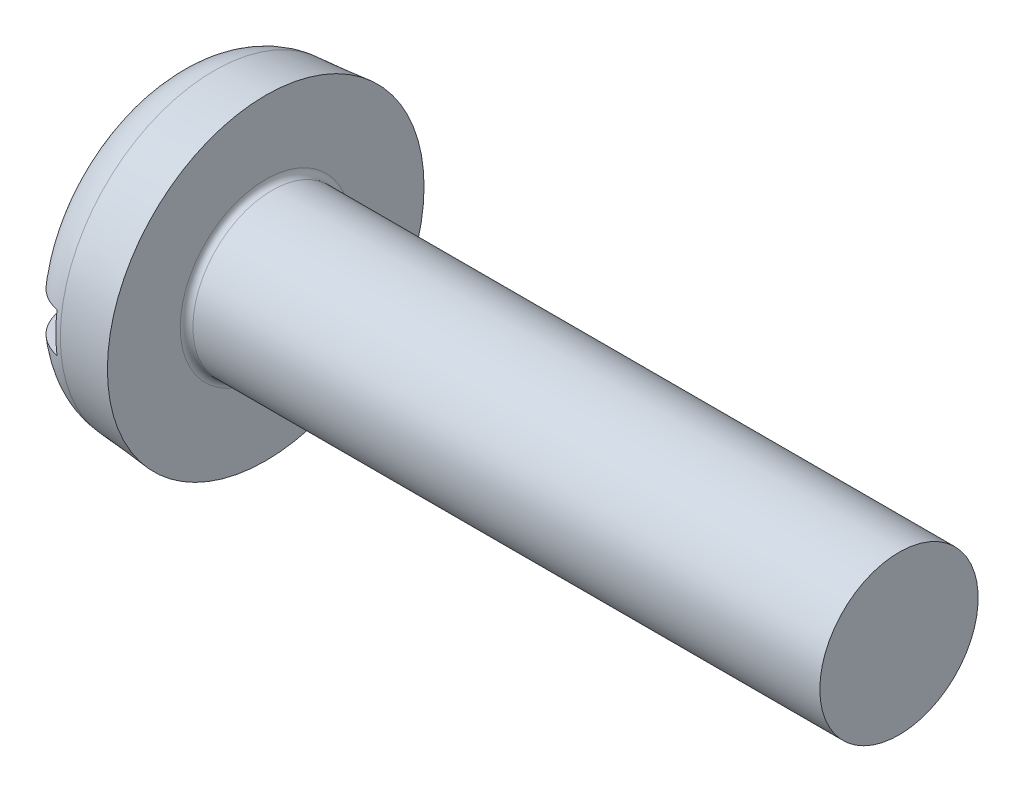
ISO-10303-21;
HEADER;
FILE_DESCRIPTION(('STEP AP214'),'2;1');
FILE_NAME('part.step','',(''),(''),'','','');
FILE_SCHEMA(('AUTOMOTIVE_DESIGN { 1 0 10303 214 1 1 1 1 }'));
ENDSEC;
DATA;
#1=APPLICATION_CONTEXT('core data for automotive mechanical design processes');
#2=APPLICATION_PROTOCOL_DEFINITION('international standard','automotive_design',2000,#1);
#3=PRODUCT_CONTEXT('',#1,'mechanical');
#4=PRODUCT('Part','Part','',(#3));
#5=PRODUCT_RELATED_PRODUCT_CATEGORY('part','',(#4));
#6=PRODUCT_DEFINITION_FORMATION('','',#4);
#7=PRODUCT_DEFINITION_CONTEXT('part definition',#1,'design');
#8=PRODUCT_DEFINITION('design','',#6,#7);
#9=PRODUCT_DEFINITION_SHAPE('','',#8);
#10=(LENGTH_UNIT() NAMED_UNIT(*) SI_UNIT(.MILLI.,.METRE.));
#11=(NAMED_UNIT(*) PLANE_ANGLE_UNIT() SI_UNIT($,.RADIAN.));
#12=(NAMED_UNIT(*) SI_UNIT($,.STERADIAN.) SOLID_ANGLE_UNIT());
#13=UNCERTAINTY_MEASURE_WITH_UNIT(LENGTH_MEASURE(1.E-05),#10,'distance_accuracy_value','');
#14=(GEOMETRIC_REPRESENTATION_CONTEXT(3) GLOBAL_UNCERTAINTY_ASSIGNED_CONTEXT((#13)) GLOBAL_UNIT_ASSIGNED_CONTEXT((#10,
#11,#12)) REPRESENTATION_CONTEXT('',''));
#15=CARTESIAN_POINT('',(0.,0.,0.));
#16=DIRECTION('',(0.,0.,1.));
#17=DIRECTION('',(1.,0.,0.));
#18=AXIS2_PLACEMENT_3D('',#15,#16,#17);
#19=CARTESIAN_POINT('',(0.,0.,0.));
#20=DIRECTION('',(1.,0.,0.));
#21=DIRECTION('',(0.,0.,-1.));
#22=AXIS2_PLACEMENT_3D('',#19,#20,#21);
#23=PLANE('',#22);
#24=CARTESIAN_POINT('',(0.,0.,0.));
#25=DIRECTION('',(1.,0.,0.));
#26=DIRECTION('',(0.,0.,-1.));
#27=AXIS2_PLACEMENT_3D('',#24,#25,#26);
#28=CIRCLE('',#27,6.72607449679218);
#29=CARTESIAN_POINT('',(0.,1.25,6.60890143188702));
#30=VERTEX_POINT('',#29);
#31=CARTESIAN_POINT('',(0.,1.25,-6.60890143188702));
#32=VERTEX_POINT('',#31);
#33=EDGE_CURVE('E92',#30,#32,#28,.F.);
#34=ORIENTED_EDGE('',*,*,#33,.T.);
#35=DIRECTION('',(0.,0.,-1.));
#36=VECTOR('',#35,1.);
#37=CARTESIAN_POINT('',(0.,1.25,-10.));
#38=LINE('',#37,#36);
#39=EDGE_CURVE('E84',#30,#32,#38,.T.);
#40=ORIENTED_EDGE('',*,*,#39,.F.);
#41=EDGE_LOOP('',(#34,#40));
#42=FACE_BOUND('',#41,.T.);
#43=ADVANCED_FACE('F33',(#42),#23,.F.);
#44=CARTESIAN_POINT('',(0.,-1.25,-6.60890143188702));
#45=VERTEX_POINT('',#44);
#46=CARTESIAN_POINT('',(0.,-1.25,6.60890143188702));
#47=VERTEX_POINT('',#46);
#48=EDGE_CURVE('E83',#45,#47,#28,.F.);
#49=ORIENTED_EDGE('',*,*,#48,.T.);
#50=DIRECTION('',(0.,0.,1.));
#51=VECTOR('',#50,1.);
#52=CARTESIAN_POINT('',(0.,-1.25,-10.));
#53=LINE('',#52,#51);
#54=EDGE_CURVE('E76',#45,#47,#53,.T.);
#55=ORIENTED_EDGE('',*,*,#54,.F.);
#56=EDGE_LOOP('',(#49,#55));
#57=FACE_BOUND('',#56,.T.);
#58=ADVANCED_FACE('F82',(#57),#23,.F.);
#59=CARTESIAN_POINT('',(6.,0.,0.));
#60=DIRECTION('',(1.,0.,0.));
#61=DIRECTION('',(0.,0.,-1.));
#62=AXIS2_PLACEMENT_3D('',#59,#60,#61);
#63=CONICAL_SURFACE('',#62,10.,0.0872664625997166);
#64=CARTESIAN_POINT('',(2.73853277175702,0.,0.));
#65=DIRECTION('',(-1.,0.,0.));
#66=DIRECTION('',(0.,0.,1.));
#67=AXIS2_PLACEMENT_3D('',#64,#65,#66);
#68=CIRCLE('',#67,9.71465859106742);
#69=CARTESIAN_POINT('',(2.73853277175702,0.,9.71465859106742));
#70=VERTEX_POINT('',#69);
#71=EDGE_CURVE('E91',#70,#70,#68,.F.);
#72=ORIENTED_EDGE('',*,*,#71,.T.);
#73=EDGE_LOOP('',(#72));
#74=FACE_BOUND('',#73,.T.);
#75=CARTESIAN_POINT('',(6.,0.,0.));
#76=DIRECTION('',(-1.,0.,0.));
#77=DIRECTION('',(0.,0.,1.));
#78=AXIS2_PLACEMENT_3D('',#75,#76,#77);
#79=CIRCLE('',#78,10.);
#80=CARTESIAN_POINT('',(6.,0.,10.));
#81=VERTEX_POINT('',#80);
#82=EDGE_CURVE('E98',#81,#81,#79,.T.);
#83=ORIENTED_EDGE('',*,*,#82,.T.);
#84=EDGE_LOOP('',(#83));
#85=FACE_BOUND('',#84,.T.);
#86=ADVANCED_FACE('F139',(#74,#85),#63,.T.);
#87=CARTESIAN_POINT('',(6.,10.,0.));
#88=DIRECTION('',(-1.,0.,0.));
#89=DIRECTION('',(0.,0.,1.));
#90=AXIS2_PLACEMENT_3D('',#87,#88,#89);
#91=PLANE('',#90);
#92=CARTESIAN_POINT('',(6.,0.,0.));
#93=DIRECTION('',(-1.,0.,0.));
#94=DIRECTION('',(0.,0.,1.));
#95=AXIS2_PLACEMENT_3D('',#92,#93,#94);
#96=CIRCLE('',#95,5.4);
#97=CARTESIAN_POINT('',(6.,0.,5.4));
#98=VERTEX_POINT('',#97);
#99=EDGE_CURVE('E95',#98,#98,#96,.T.);
#100=ORIENTED_EDGE('',*,*,#99,.T.);
#101=EDGE_LOOP('',(#100));
#102=FACE_BOUND('',#101,.T.);
#103=ORIENTED_EDGE('',*,*,#82,.F.);
#104=EDGE_LOOP('',(#103));
#105=FACE_BOUND('',#104,.T.);
#106=ADVANCED_FACE('F135',(#102,#105),#91,.F.);
#107=CARTESIAN_POINT('',(0.,0.,0.));
#108=DIRECTION('',(-1.,0.,0.));
#109=DIRECTION('',(0.,0.,1.));
#110=AXIS2_PLACEMENT_3D('',#107,#108,#109);
#111=CYLINDRICAL_SURFACE('',#110,5.);
#112=CARTESIAN_POINT('',(6.4,0.,0.));
#113=DIRECTION('',(-1.,0.,0.));
#114=DIRECTION('',(0.,0.,1.));
#115=AXIS2_PLACEMENT_3D('',#112,#113,#114);
#116=CIRCLE('',#115,5.);
#117=CARTESIAN_POINT('',(6.4,0.,5.));
#118=VERTEX_POINT('',#117);
#119=EDGE_CURVE('E104',#118,#118,#116,.F.);
#120=ORIENTED_EDGE('',*,*,#119,.T.);
#121=EDGE_LOOP('',(#120));
#122=FACE_BOUND('',#121,.T.);
#123=CARTESIAN_POINT('',(46.,0.,0.));
#124=DIRECTION('',(-1.,0.,0.));
#125=DIRECTION('',(0.,0.,1.));
#126=AXIS2_PLACEMENT_3D('',#123,#124,#125);
#127=CIRCLE('',#126,5.);
#128=CARTESIAN_POINT('',(46.,0.,5.));
#129=VERTEX_POINT('',#128);
#130=EDGE_CURVE('E156',#129,#129,#127,.T.);
#131=ORIENTED_EDGE('',*,*,#130,.T.);
#132=EDGE_LOOP('',(#131));
#133=FACE_BOUND('',#132,.T.);
#134=ADVANCED_FACE('F131',(#122,#133),#111,.T.);
#135=CARTESIAN_POINT('',(46.,5.,0.));
#136=DIRECTION('',(-1.,0.,0.));
#137=DIRECTION('',(0.,0.,1.));
#138=AXIS2_PLACEMENT_3D('',#135,#136,#137);
#139=PLANE('',#138);
#140=ORIENTED_EDGE('',*,*,#130,.F.);
#141=EDGE_LOOP('',(#140));
#142=FACE_BOUND('',#141,.T.);
#143=ADVANCED_FACE('F125',(#142),#139,.F.);
#144=CARTESIAN_POINT('',(3.,0.,0.));
#145=DIRECTION('',(1.,0.,0.));
#146=DIRECTION('',(0.,0.,-1.));
#147=AXIS2_PLACEMENT_3D('',#144,#145,#146);
#148=TOROIDAL_SURFACE('',#147,6.72607449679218,3.);
#149=CARTESIAN_POINT('',(0.913950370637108,1.25,-8.79369083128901));
#150=CARTESIAN_POINT('',(1.03407751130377,1.25,-8.91107806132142));
#151=CARTESIAN_POINT('',(1.16414710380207,1.25,-9.0184570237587));
#152=CARTESIAN_POINT('',(1.44055548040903,1.25,-9.20996884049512));
#153=CARTESIAN_POINT('',(1.58691212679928,1.25,-9.29407581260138));
#154=CARTESIAN_POINT('',(1.89167269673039,1.25,-9.43645928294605));
#155=CARTESIAN_POINT('',(2.0500739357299,1.25,-9.49474151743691));
#156=CARTESIAN_POINT('',(2.37439631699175,1.25,-9.58375548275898));
#157=CARTESIAN_POINT('',(2.54031567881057,1.25,-9.61449370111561));
#158=CARTESIAN_POINT('',(2.87435662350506,1.25,-9.64747712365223));
#159=CARTESIAN_POINT('',(3.04246808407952,1.25,-9.64982487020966));
#160=CARTESIAN_POINT('',(3.37669612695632,1.25,-9.62622242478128));
#161=CARTESIAN_POINT('',(3.54281266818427,1.25,-9.6002716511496));
#162=CARTESIAN_POINT('',(3.8681098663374,1.25,-9.52088746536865));
#163=CARTESIAN_POINT('',(4.02729932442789,1.25,-9.46749010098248));
#164=CARTESIAN_POINT('',(4.33448631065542,1.25,-9.33479520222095));
#165=CARTESIAN_POINT('',(4.48248380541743,1.25,-9.25549759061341));
#166=CARTESIAN_POINT('',(4.76352766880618,1.25,-9.07306642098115));
#167=CARTESIAN_POINT('',(4.89653363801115,1.25,-8.96987064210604));
#168=CARTESIAN_POINT('',(5.14347241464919,1.25,-8.74274923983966));
#169=CARTESIAN_POINT('',(5.25740480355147,1.25,-8.61882316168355));
#170=CARTESIAN_POINT('',(5.46381187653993,1.25,-8.35290133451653));
#171=CARTESIAN_POINT('',(5.5561381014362,1.25,-8.21079038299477));
#172=CARTESIAN_POINT('',(5.71591382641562,1.25,-7.91321813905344));
#173=CARTESIAN_POINT('',(5.78336219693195,1.25,-7.75775624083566));
#174=CARTESIAN_POINT('',(5.89229296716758,1.25,-7.43609765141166));
#175=CARTESIAN_POINT('',(5.93348408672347,1.25,-7.26980235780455));
#176=CARTESIAN_POINT('',(5.98780094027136,1.25,-6.93269546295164));
#177=CARTESIAN_POINT('',(6.00092472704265,1.25,-6.76188354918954));
#178=CARTESIAN_POINT('',(5.99895954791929,1.25,-6.41790932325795));
#179=CARTESIAN_POINT('',(5.98345242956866,1.25,-6.24474942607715));
#180=CARTESIAN_POINT('',(5.9240547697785,1.25,-5.90336911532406));
#181=CARTESIAN_POINT('',(5.88016160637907,1.25,-5.73514915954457));
#182=CARTESIAN_POINT('',(5.76444528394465,1.25,-5.40563318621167));
#183=CARTESIAN_POINT('',(5.69219500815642,1.25,-5.24448707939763));
#184=CARTESIAN_POINT('',(5.52187152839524,1.25,-4.93645275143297));
#185=CARTESIAN_POINT('',(5.42379531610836,1.25,-4.78956619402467));
#186=CARTESIAN_POINT('',(5.20362037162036,1.25,-4.51322087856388));
#187=CARTESIAN_POINT('',(5.08134720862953,1.25,-4.38390089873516));
#188=CARTESIAN_POINT('',(4.81646755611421,1.25,-4.14804563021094));
#189=CARTESIAN_POINT('',(4.67386150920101,1.25,-4.04150984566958));
#190=CARTESIAN_POINT('',(4.37493583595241,1.25,-3.85675206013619));
#191=CARTESIAN_POINT('',(4.21891607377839,1.25,-3.77804611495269));
#192=CARTESIAN_POINT('',(3.89540554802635,1.25,-3.64953247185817));
#193=CARTESIAN_POINT('',(3.72792001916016,1.25,-3.59971168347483));
#194=CARTESIAN_POINT('',(3.39522326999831,1.25,-3.53305783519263));
#195=CARTESIAN_POINT('',(3.23031745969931,1.25,-3.51469914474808));
#196=CARTESIAN_POINT('',(2.89985413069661,1.25,-3.50709369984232));
#197=CARTESIAN_POINT('',(2.73429676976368,1.25,-3.51784028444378));
#198=CARTESIAN_POINT('',(2.4134877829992,1.25,-3.56699036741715));
#199=CARTESIAN_POINT('',(2.25807967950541,1.25,-3.60438488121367));
#200=CARTESIAN_POINT('',(1.95549755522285,1.25,-3.70411822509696));
#201=CARTESIAN_POINT('',(1.80832473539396,1.25,-3.76646068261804));
#202=CARTESIAN_POINT('',(1.52239485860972,1.25,-3.91558892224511));
#203=CARTESIAN_POINT('',(1.38392868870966,1.25,-4.00293114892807));
#204=CARTESIAN_POINT('',(1.12266061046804,1.25,-4.19852761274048));
#205=CARTESIAN_POINT('',(0.999862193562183,1.25,-4.30678649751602));
#206=CARTESIAN_POINT('',(0.766801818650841,1.25,-4.54725082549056));
#207=CARTESIAN_POINT('',(0.657519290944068,1.25,-4.68040649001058));
#208=CARTESIAN_POINT('',(0.462072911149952,1.25,-4.96272965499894));
#209=CARTESIAN_POINT('',(0.375912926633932,1.25,-5.11189982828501));
#210=CARTESIAN_POINT('',(0.226781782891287,1.25,-5.42688300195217));
#211=CARTESIAN_POINT('',(0.164574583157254,1.25,-5.59305850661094));
#212=CARTESIAN_POINT('',(0.0689385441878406,1.25,-5.93349549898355));
#213=CARTESIAN_POINT('',(0.0355092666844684,1.25,-6.10775686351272));
#214=CARTESIAN_POINT('',(-0.0014134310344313,1.25,-6.45940175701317));
#215=CARTESIAN_POINT('',(-0.00491262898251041,1.25,-6.63678467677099));
#216=CARTESIAN_POINT('',(0.0183732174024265,1.25,-6.98960681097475));
#217=CARTESIAN_POINT('',(0.0451639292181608,1.25,-7.16504565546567));
#218=CARTESIAN_POINT('',(0.127908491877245,1.25,-7.50633395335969));
#219=CARTESIAN_POINT('',(0.18345582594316,1.25,-7.67228216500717));
#220=CARTESIAN_POINT('',(0.32204168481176,1.25,-7.99211018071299));
#221=CARTESIAN_POINT('',(0.405044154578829,1.25,-8.14600548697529));
#222=CARTESIAN_POINT('',(0.560173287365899,1.25,-8.38236701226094));
#223=CARTESIAN_POINT('',(0.624662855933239,1.25,-8.46994047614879));
#224=CARTESIAN_POINT('',(0.762698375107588,1.25,-8.63763545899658));
#225=CARTESIAN_POINT('',(0.836244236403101,1.25,-8.71775705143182));
#226=CARTESIAN_POINT('',(0.913950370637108,1.25,-8.79369083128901));
#227=B_SPLINE_CURVE_WITH_KNOTS('',3,(#149,#150,#151,#152,#153,#154,#155,#156,#157,#158,#159,
#160,#161,#162,#163,#164,#165,#166,#167,#168,#169,#170,#171,#172,#173,#174,#175,#176,#177,#178,
#179,#180,#181,#182,#183,#184,#185,#186,#187,#188,#189,#190,#191,#192,#193,#194,#195,#196,#197,
#198,#199,#200,#201,#202,#203,#204,#205,#206,#207,#208,#209,#210,#211,#212,#213,#214,#215,#216,
#217,#218,#219,#220,#221,#222,#223,#224,#225,#226),.UNSPECIFIED.,.T.,.F.,(4,2,2,2,2,2,2,2,2,2,2,
2,2,2,2,2,2,2,2,2,2,2,2,2,2,2,2,2,2,2,2,2,2,2,2,2,2,2,4),(0.,0.503484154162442,1.00752603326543,
1.51145589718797,2.01526703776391,2.51725793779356,3.01925915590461,3.52060273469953,
4.02194780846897,4.52461314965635,5.02728951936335,5.53332459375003,6.0393826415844,
6.55096110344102,7.0625750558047,7.58172027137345,8.10091344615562,8.62824690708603,
9.15564182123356,9.68698702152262,10.2183206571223,10.7398986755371,11.2612401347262,
11.7564997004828,12.2516459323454,12.7289772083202,13.2063779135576,13.6953635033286,
14.1844578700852,14.6988978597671,15.2134238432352,15.7432176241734,16.2730033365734,
16.8026867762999,17.3324693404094,17.8549592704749,18.3767657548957,18.7024556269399,
19.0281422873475),.UNSPECIFIED.);
#228=CARTESIAN_POINT('',(2.4,1.25,-9.58429232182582));
#229=VERTEX_POINT('',#228);
#230=EDGE_CURVE('E11',#32,#229,#227,.T.);
#231=ORIENTED_EDGE('',*,*,#230,.F.);
#232=ORIENTED_EDGE('',*,*,#33,.F.);
#233=CARTESIAN_POINT('',(1.42400410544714,1.25,3.98178611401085));
#234=CARTESIAN_POINT('',(1.5612667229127,1.25,3.89297012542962));
#235=CARTESIAN_POINT('',(1.70580035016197,1.25,3.81523437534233));
#236=CARTESIAN_POINT('',(2.00584163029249,1.25,3.68474127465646));
#237=CARTESIAN_POINT('',(2.16135542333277,1.25,3.63199802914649));
#238=CARTESIAN_POINT('',(2.4793742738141,1.25,3.55367301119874));
#239=CARTESIAN_POINT('',(2.64188954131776,1.25,3.52813240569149));
#240=CARTESIAN_POINT('',(2.96885435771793,1.25,3.50557748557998));
#241=CARTESIAN_POINT('',(3.1333033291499,1.25,3.50855486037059));
#242=CARTESIAN_POINT('',(3.45489323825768,1.25,3.54240853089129));
#243=CARTESIAN_POINT('',(3.61211260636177,1.25,3.57254854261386));
#244=CARTESIAN_POINT('',(3.91940624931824,1.25,3.65837971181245));
#245=CARTESIAN_POINT('',(4.06947936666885,1.25,3.71407499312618));
#246=CARTESIAN_POINT('',(4.36105131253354,1.25,3.84997531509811));
#247=CARTESIAN_POINT('',(4.50236952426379,1.25,3.93056672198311));
#248=CARTESIAN_POINT('',(4.77037282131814,1.25,4.11320469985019));
#249=CARTESIAN_POINT('',(4.89705478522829,1.25,4.21525583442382));
#250=CARTESIAN_POINT('',(5.13904911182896,1.25,4.44362846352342));
#251=CARTESIAN_POINT('',(5.25343578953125,1.25,4.57093155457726));
#252=CARTESIAN_POINT('',(5.46008362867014,1.25,4.84238649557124));
#253=CARTESIAN_POINT('',(5.55234077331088,1.25,4.98654139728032));
#254=CARTESIAN_POINT('',(5.71512091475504,1.25,5.29301673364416));
#255=CARTESIAN_POINT('',(5.78479444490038,1.25,5.45578930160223));
#256=CARTESIAN_POINT('',(5.89593523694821,1.25,5.79070335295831));
#257=CARTESIAN_POINT('',(5.93740130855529,1.25,5.96284523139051));
#258=CARTESIAN_POINT('',(5.99085637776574,1.25,6.31223598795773));
#259=CARTESIAN_POINT('',(6.00274901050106,1.25,6.48949966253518));
#260=CARTESIAN_POINT('',(5.99618345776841,1.25,6.84347053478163));
#261=CARTESIAN_POINT('',(5.97772699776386,1.25,7.02017776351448));
#262=CARTESIAN_POINT('',(5.91120016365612,1.25,7.36550565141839));
#263=CARTESIAN_POINT('',(5.86352491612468,1.25,7.53420237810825));
#264=CARTESIAN_POINT('',(5.74006872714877,1.25,7.86098193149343));
#265=CARTESIAN_POINT('',(5.66429014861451,1.25,8.01906564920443));
#266=CARTESIAN_POINT('',(5.48810579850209,1.25,8.31744548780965));
#267=CARTESIAN_POINT('',(5.38811325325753,1.25,8.4579856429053));
#268=CARTESIAN_POINT('',(5.16566608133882,1.25,8.71999862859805));
#269=CARTESIAN_POINT('',(5.04321309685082,1.25,8.84147285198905));
#270=CARTESIAN_POINT('',(4.78105062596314,1.25,9.06026678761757));
#271=CARTESIAN_POINT('',(4.6415850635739,1.25,9.1578788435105));
#272=CARTESIAN_POINT('',(4.34813222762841,1.25,9.32806433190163));
#273=CARTESIAN_POINT('',(4.19414569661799,1.25,9.40063904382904));
#274=CARTESIAN_POINT('',(3.87745295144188,1.25,9.5180728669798));
#275=CARTESIAN_POINT('',(3.71483300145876,1.25,9.5631646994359));
#276=CARTESIAN_POINT('',(3.38431824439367,1.25,9.62527419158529));
#277=CARTESIAN_POINT('',(3.21642359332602,1.25,9.64229268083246));
#278=CARTESIAN_POINT('',(2.88090253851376,1.25,9.64774078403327));
#279=CARTESIAN_POINT('',(2.71327812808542,1.25,9.63629403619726));
#280=CARTESIAN_POINT('',(2.38233537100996,1.25,9.58540890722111));
#281=CARTESIAN_POINT('',(2.21901698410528,1.25,9.54597078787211));
#282=CARTESIAN_POINT('',(1.90136639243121,1.25,9.44027844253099));
#283=CARTESIAN_POINT('',(1.74703114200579,1.25,9.37403336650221));
#284=CARTESIAN_POINT('',(1.45161989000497,1.25,9.21666160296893));
#285=CARTESIAN_POINT('',(1.31054399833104,1.25,9.12553470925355));
#286=CARTESIAN_POINT('',(1.04508569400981,1.25,8.92067026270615));
#287=CARTESIAN_POINT('',(0.920765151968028,1.25,8.80685255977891));
#288=CARTESIAN_POINT('',(0.69282275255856,1.25,8.56010291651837));
#289=CARTESIAN_POINT('',(0.58920150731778,1.25,8.42717041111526));
#290=CARTESIAN_POINT('',(0.404709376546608,1.25,8.14489607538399));
#291=CARTESIAN_POINT('',(0.324019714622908,1.25,7.99543583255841));
#292=CARTESIAN_POINT('',(0.188546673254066,1.25,7.68520850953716));
#293=CARTESIAN_POINT('',(0.133764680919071,1.25,7.52444082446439));
#294=CARTESIAN_POINT('',(0.0509263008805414,1.25,7.19412294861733));
#295=CARTESIAN_POINT('',(0.023196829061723,1.25,7.02449081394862));
#296=CARTESIAN_POINT('',(-0.00385005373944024,1.25,6.68298800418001));
#297=CARTESIAN_POINT('',(-0.00316643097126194,1.25,6.51111724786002));
#298=CARTESIAN_POINT('',(0.0265926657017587,1.25,6.16720755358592));
#299=CARTESIAN_POINT('',(0.056101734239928,1.25,5.99520616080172));
#300=CARTESIAN_POINT('',(0.143149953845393,1.25,5.65840060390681));
#301=CARTESIAN_POINT('',(0.20069836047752,1.25,5.49359883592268));
#302=CARTESIAN_POINT('',(0.34321319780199,1.25,5.17328528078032));
#303=CARTESIAN_POINT('',(0.428585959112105,1.25,5.01795437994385));
#304=CARTESIAN_POINT('',(0.624063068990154,1.25,4.72386676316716));
#305=CARTESIAN_POINT('',(0.734143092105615,1.25,4.58509394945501));
#306=CARTESIAN_POINT('',(0.939954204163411,1.25,4.36648585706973));
#307=CARTESIAN_POINT('',(1.03018849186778,1.25,4.28140949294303));
#308=CARTESIAN_POINT('',(1.2202259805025,1.25,4.12269833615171));
#309=CARTESIAN_POINT('',(1.32002902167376,1.25,4.04906335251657));
#310=CARTESIAN_POINT('',(1.42400410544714,1.25,3.98178611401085));
#311=B_SPLINE_CURVE_WITH_KNOTS('',3,(#233,#234,#235,#236,#237,#238,#239,#240,#241,#242,#243,
#244,#245,#246,#247,#248,#249,#250,#251,#252,#253,#254,#255,#256,#257,#258,#259,#260,#261,#262,
#263,#264,#265,#266,#267,#268,#269,#270,#271,#272,#273,#274,#275,#276,#277,#278,#279,#280,#281,
#282,#283,#284,#285,#286,#287,#288,#289,#290,#291,#292,#293,#294,#295,#296,#297,#298,#299,#300,
#301,#302,#303,#304,#305,#306,#307,#308,#309,#310),.UNSPECIFIED.,.T.,.F.,(4,2,2,2,2,2,2,2,2,2,2,
2,2,2,2,2,2,2,2,2,2,2,2,2,2,2,2,2,2,2,2,2,2,2,2,2,2,2,4),(0.,0.490052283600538,
0.980380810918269,1.47145032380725,1.96237673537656,2.44038333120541,2.91846708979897,
3.40437848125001,3.89039331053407,4.40152059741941,4.91274059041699,5.44141242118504,
5.97010655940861,6.50052119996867,7.03090568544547,7.55427135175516,8.07759302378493,
8.59254557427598,9.10746048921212,9.61570935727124,10.1239322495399,10.6277895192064,
11.1316318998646,11.633289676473,12.1349427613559,12.6364247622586,13.1379109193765,
13.6412008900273,14.1445057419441,14.6516840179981,15.1588894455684,15.6721509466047,
16.1854311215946,16.7065528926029,17.2278467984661,17.7571227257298,18.2858798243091,
18.657095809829,19.0283055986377),.UNSPECIFIED.);
#312=CARTESIAN_POINT('',(2.4,1.25,9.58429232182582));
#313=VERTEX_POINT('',#312);
#314=EDGE_CURVE('E113',#313,#30,#311,.T.);
#315=ORIENTED_EDGE('',*,*,#314,.F.);
#316=CARTESIAN_POINT('',(2.4,0.,0.));
#317=DIRECTION('',(-1.,0.,0.));
#318=DIRECTION('',(0.,0.,1.));
#319=AXIS2_PLACEMENT_3D('',#316,#317,#318);
#320=CIRCLE('',#319,9.665462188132);
#321=CARTESIAN_POINT('',(2.4,-1.25,9.58429232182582));
#322=VERTEX_POINT('',#321);
#323=EDGE_CURVE('E107',#313,#322,#320,.F.);
#324=ORIENTED_EDGE('',*,*,#323,.T.);
#325=CARTESIAN_POINT('',(1.42400410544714,-1.25,3.98178611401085));
#326=CARTESIAN_POINT('',(1.27725127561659,-1.25,4.07675719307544));
#327=CARTESIAN_POINT('',(1.13859909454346,-1.25,4.18453932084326));
#328=CARTESIAN_POINT('',(0.88127824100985,-1.25,4.42203149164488));
#329=CARTESIAN_POINT('',(0.762645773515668,-1.25,4.55178043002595));
#330=CARTESIAN_POINT('',(0.548773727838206,-1.25,4.82899748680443));
#331=CARTESIAN_POINT('',(0.453498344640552,-1.25,4.97643796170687));
#332=CARTESIAN_POINT('',(0.288693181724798,-1.25,5.28498247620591));
#333=CARTESIAN_POINT('',(0.219153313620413,-1.25,5.44608113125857));
#334=CARTESIAN_POINT('',(0.106971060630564,-1.25,5.7798739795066));
#335=CARTESIAN_POINT('',(0.0647116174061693,-1.25,5.95269714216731));
#336=CARTESIAN_POINT('',(0.0100221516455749,-1.25,6.30302303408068));
#337=CARTESIAN_POINT('',(-0.00240602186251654,-1.25,6.48052605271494));
#338=CARTESIAN_POINT('',(0.00315593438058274,-1.25,6.83381450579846));
#339=CARTESIAN_POINT('',(0.02093258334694,-1.25,7.00960323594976));
#340=CARTESIAN_POINT('',(0.0862335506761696,-1.25,7.35556997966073));
#341=CARTESIAN_POINT('',(0.133755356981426,-1.25,7.52574846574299));
#342=CARTESIAN_POINT('',(0.256391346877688,-1.25,7.8527951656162));
#343=CARTESIAN_POINT('',(0.33105870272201,-1.25,8.00983092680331));
#344=CARTESIAN_POINT('',(0.506081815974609,-1.25,8.30887056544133));
#345=CARTESIAN_POINT('',(0.606435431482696,-1.25,8.45087569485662));
#346=CARTESIAN_POINT('',(0.828351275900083,-1.25,8.71360142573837));
#347=CARTESIAN_POINT('',(0.949576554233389,-1.25,8.83460669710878));
#348=CARTESIAN_POINT('',(1.21081660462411,-1.25,9.054274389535));
#349=CARTESIAN_POINT('',(1.35083022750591,-1.25,9.15293817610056));
#350=CARTESIAN_POINT('',(1.64402340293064,-1.25,9.3240264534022));
#351=CARTESIAN_POINT('',(1.79704381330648,-1.25,9.39672374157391));
#352=CARTESIAN_POINT('',(2.11317116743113,-1.25,9.51520554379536));
#353=CARTESIAN_POINT('',(2.27627769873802,-1.25,9.56099115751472));
#354=CARTESIAN_POINT('',(2.60681252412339,-1.25,9.6240827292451));
#355=CARTESIAN_POINT('',(2.77420606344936,-1.25,9.64157088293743));
#356=CARTESIAN_POINT('',(3.10954711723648,-1.25,9.64812292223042));
#357=CARTESIAN_POINT('',(3.27749462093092,-1.25,9.637187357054));
#358=CARTESIAN_POINT('',(3.60876227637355,-1.25,9.58727457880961));
#359=CARTESIAN_POINT('',(3.77209238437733,-1.25,9.54836339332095));
#360=CARTESIAN_POINT('',(4.0899162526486,-1.25,9.44371397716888));
#361=CARTESIAN_POINT('',(4.24441001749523,-1.25,9.37797576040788));
#362=CARTESIAN_POINT('',(4.5404588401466,-1.25,9.22146553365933));
#363=CARTESIAN_POINT('',(4.6819930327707,-1.25,9.13065406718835));
#364=CARTESIAN_POINT('',(4.94791239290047,-1.25,8.92668118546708));
#365=CARTESIAN_POINT('',(5.07229724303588,-1.25,8.81351935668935));
#366=CARTESIAN_POINT('',(5.30116231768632,-1.25,8.56741311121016));
#367=CARTESIAN_POINT('',(5.40552756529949,-1.25,8.43436179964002));
#368=CARTESIAN_POINT('',(5.59068859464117,-1.25,8.15276815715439));
#369=CARTESIAN_POINT('',(5.67148346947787,-1.25,8.00422523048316));
#370=CARTESIAN_POINT('',(5.80809437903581,-1.25,7.69433085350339));
#371=CARTESIAN_POINT('',(5.86365839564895,-1.25,7.53286834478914));
#372=CARTESIAN_POINT('',(5.94729502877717,-1.25,7.20297962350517));
#373=CARTESIAN_POINT('',(5.97536591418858,-1.25,7.0345529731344));
#374=CARTESIAN_POINT('',(6.00366240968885,-1.25,6.69303316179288));
#375=CARTESIAN_POINT('',(6.00349747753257,-1.25,6.51990767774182));
#376=CARTESIAN_POINT('',(5.97458490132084,-1.25,6.17606321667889));
#377=CARTESIAN_POINT('',(5.94583479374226,-1.25,6.00534444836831));
#378=CARTESIAN_POINT('',(5.86004783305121,-1.25,5.66826012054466));
#379=CARTESIAN_POINT('',(5.80256656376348,-1.25,5.50200762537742));
#380=CARTESIAN_POINT('',(5.66082163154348,-1.25,5.18132875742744));
#381=CARTESIAN_POINT('',(5.57655497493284,-1.25,5.02690370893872));
#382=CARTESIAN_POINT('',(5.38247308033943,-1.25,4.73255054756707));
#383=CARTESIAN_POINT('',(5.27238473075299,-1.25,4.5928023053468));
#384=CARTESIAN_POINT('',(5.0301036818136,-1.25,4.33394617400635));
#385=CARTESIAN_POINT('',(4.89790962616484,-1.25,4.21483955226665));
#386=CARTESIAN_POINT('',(4.61627663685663,-1.25,4.00224187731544));
#387=CARTESIAN_POINT('',(4.46701558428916,-1.25,3.90851571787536));
#388=CARTESIAN_POINT('',(4.15433964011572,-1.25,3.7487749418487));
#389=CARTESIAN_POINT('',(3.99093056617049,-1.25,3.68274899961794));
#390=CARTESIAN_POINT('',(3.66220213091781,-1.25,3.58358623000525));
#391=CARTESIAN_POINT('',(3.49727931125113,-1.25,3.54913656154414));
#392=CARTESIAN_POINT('',(3.1639116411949,-1.25,3.50993553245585));
#393=CARTESIAN_POINT('',(2.99546709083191,-1.25,3.50518165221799));
#394=CARTESIAN_POINT('',(2.66816300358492,-1.25,3.52512294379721));
#395=CARTESIAN_POINT('',(2.50921866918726,-1.25,3.5484750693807));
#396=CARTESIAN_POINT('',(2.1975963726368,-1.25,3.62133535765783));
#397=CARTESIAN_POINT('',(2.0449113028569,-1.25,3.67081291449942));
#398=CARTESIAN_POINT('',(1.81492039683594,-1.25,3.7666537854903));
#399=CARTESIAN_POINT('',(1.73406893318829,-1.25,3.80476648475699));
#400=CARTESIAN_POINT('',(1.57610803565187,-1.25,3.88806663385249));
#401=CARTESIAN_POINT('',(1.49899834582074,-1.25,3.93325359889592));
#402=CARTESIAN_POINT('',(1.42400410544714,-1.25,3.98178611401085));
#403=B_SPLINE_CURVE_WITH_KNOTS('',3,(#325,#326,#327,#328,#329,#330,#331,#332,#333,#334,#335,
#336,#337,#338,#339,#340,#341,#342,#343,#344,#345,#346,#347,#348,#349,#350,#351,#352,#353,#354,
#355,#356,#357,#358,#359,#360,#361,#362,#363,#364,#365,#366,#367,#368,#369,#370,#371,#372,#373,
#374,#375,#376,#377,#378,#379,#380,#381,#382,#383,#384,#385,#386,#387,#388,#389,#390,#391,#392,
#393,#394,#395,#396,#397,#398,#399,#400,#401,#402),.UNSPECIFIED.,.T.,.F.,(4,2,2,2,2,2,2,2,2,2,2,
2,2,2,2,2,2,2,2,2,2,2,2,2,2,2,2,2,2,2,2,2,2,2,2,2,2,2,4),(0.,0.52406917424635,1.04907618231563,
1.57327328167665,2.09726467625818,2.62846011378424,3.15968847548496,3.68717783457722,
4.21462265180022,4.73375188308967,5.25283783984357,5.76421810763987,6.27556711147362,
6.78137400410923,7.28716022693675,7.78967675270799,8.29218356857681,8.79350825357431,
9.29483267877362,9.79695055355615,10.2990777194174,10.8040076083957,11.3089569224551,
11.8188445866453,12.3287643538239,12.8457376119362,13.3627554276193,13.8880301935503,
14.4133636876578,14.94452627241,15.4757214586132,16.0018132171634,16.5276896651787,
17.0305528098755,17.5333732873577,18.013090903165,18.4922477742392,18.7600781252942,
19.027890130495),.UNSPECIFIED.);
#404=EDGE_CURVE('E90',#47,#322,#403,.T.);
#405=ORIENTED_EDGE('',*,*,#404,.F.);
#406=ORIENTED_EDGE('',*,*,#48,.F.);
#407=CARTESIAN_POINT('',(0.913950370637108,-1.25,-8.79369083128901));
#408=CARTESIAN_POINT('',(0.792108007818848,-1.25,-8.67460585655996));
#409=CARTESIAN_POINT('',(0.680316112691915,-1.25,-8.54504497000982));
#410=CARTESIAN_POINT('',(0.480067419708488,-1.25,-8.26882508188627));
#411=CARTESIAN_POINT('',(0.391641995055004,-1.25,-8.12214346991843));
#412=CARTESIAN_POINT('',(0.240686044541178,-1.25,-7.81619154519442));
#413=CARTESIAN_POINT('',(0.178129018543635,-1.25,-7.65693431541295));
#414=CARTESIAN_POINT('',(0.0803669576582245,-1.25,-7.33029737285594));
#415=CARTESIAN_POINT('',(0.0451550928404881,-1.25,-7.16291969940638));
#416=CARTESIAN_POINT('',(0.00258611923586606,-1.25,-6.8229389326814));
#417=CARTESIAN_POINT('',(-0.00448488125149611,-1.25,-6.65030006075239));
#418=CARTESIAN_POINT('',(0.00997611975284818,-1.25,-6.30622052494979));
#419=CARTESIAN_POINT('',(0.0315117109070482,-1.25,-6.13478001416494));
#420=CARTESIAN_POINT('',(0.102962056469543,-1.25,-5.79506095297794));
#421=CARTESIAN_POINT('',(0.153323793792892,-1.25,-5.62687639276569));
#422=CARTESIAN_POINT('',(0.281213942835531,-1.25,-5.30116605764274));
#423=CARTESIAN_POINT('',(0.358745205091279,-1.25,-5.14364140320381));
#424=CARTESIAN_POINT('',(0.539940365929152,-1.25,-4.84173125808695));
#425=CARTESIAN_POINT('',(0.643916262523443,-1.25,-4.69753282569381));
#426=CARTESIAN_POINT('',(0.874729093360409,-1.25,-4.42872178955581));
#427=CARTESIAN_POINT('',(1.00156786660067,-1.25,-4.30411076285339));
#428=CARTESIAN_POINT('',(1.27395739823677,-1.25,-4.07913796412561));
#429=CARTESIAN_POINT('',(1.4193931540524,-1.25,-3.97863724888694));
#430=CARTESIAN_POINT('',(1.72562266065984,-1.25,-3.80464237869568));
#431=CARTESIAN_POINT('',(1.88641172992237,-1.25,-3.73114002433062));
#432=CARTESIAN_POINT('',(2.21202201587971,-1.25,-3.61665234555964));
#433=CARTESIAN_POINT('',(2.37642863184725,-1.25,-3.57449018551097));
#434=CARTESIAN_POINT('',(2.71009270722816,-1.25,-3.52000714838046));
#435=CARTESIAN_POINT('',(2.87934814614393,-1.25,-3.50767401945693));
#436=CARTESIAN_POINT('',(3.20890035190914,-1.25,-3.51330262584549));
#437=CARTESIAN_POINT('',(3.36922441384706,-1.25,-3.52978963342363));
#438=CARTESIAN_POINT('',(3.68480899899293,-1.25,-3.58947417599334));
#439=CARTESIAN_POINT('',(3.84006927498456,-1.25,-3.6326730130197));
#440=CARTESIAN_POINT('',(4.14135724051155,-1.25,-3.74396700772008));
#441=CARTESIAN_POINT('',(4.28738453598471,-1.25,-3.81206322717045));
#442=CARTESIAN_POINT('',(4.5666816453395,-1.25,-3.97069487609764));
#443=CARTESIAN_POINT('',(4.69994881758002,-1.25,-4.06123493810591));
#444=CARTESIAN_POINT('',(4.95679363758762,-1.25,-4.26685011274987));
#445=CARTESIAN_POINT('',(5.07959092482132,-1.25,-4.38290006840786));
#446=CARTESIAN_POINT('',(5.3049399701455,-1.25,-4.63322745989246));
#447=CARTESIAN_POINT('',(5.40748756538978,-1.25,-4.76750863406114));
#448=CARTESIAN_POINT('',(5.5936608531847,-1.25,-5.0566362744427));
#449=CARTESIAN_POINT('',(5.67631915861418,-1.25,-5.21210682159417));
#450=CARTESIAN_POINT('',(5.81467598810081,-1.25,-5.53462223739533));
#451=CARTESIAN_POINT('',(5.87037241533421,-1.25,-5.70166800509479));
#452=CARTESIAN_POINT('',(5.95354424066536,-1.25,-6.04446969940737));
#453=CARTESIAN_POINT('',(5.98072576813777,-1.25,-6.2202971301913));
#454=CARTESIAN_POINT('',(6.00484460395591,-1.25,-6.57402140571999));
#455=CARTESIAN_POINT('',(6.00178308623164,-1.25,-6.75191816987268));
#456=CARTESIAN_POINT('',(5.96544964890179,-1.25,-7.1026892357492));
#457=CARTESIAN_POINT('',(5.93250012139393,-1.25,-7.27559686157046));
#458=CARTESIAN_POINT('',(5.83755669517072,-1.25,-7.61324983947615));
#459=CARTESIAN_POINT('',(5.77556521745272,-1.25,-7.77799587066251));
#460=CARTESIAN_POINT('',(5.62538756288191,-1.25,-8.09181782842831));
#461=CARTESIAN_POINT('',(5.53763971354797,-1.25,-8.24110353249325));
#462=CARTESIAN_POINT('',(5.3379902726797,-1.25,-8.5225442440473));
#463=CARTESIAN_POINT('',(5.22609051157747,-1.25,-8.65470054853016));
#464=CARTESIAN_POINT('',(4.98302054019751,-1.25,-8.89619706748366));
#465=CARTESIAN_POINT('',(4.85214098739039,-1.25,-9.00582989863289));
#466=CARTESIAN_POINT('',(4.57368157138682,-1.25,-9.20130833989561));
#467=CARTESIAN_POINT('',(4.42610262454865,-1.25,-9.28715525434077));
#468=CARTESIAN_POINT('',(4.11998467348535,-1.25,-9.43178407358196));
#469=CARTESIAN_POINT('',(3.96156573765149,-1.25,-9.4908201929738));
#470=CARTESIAN_POINT('',(3.63704088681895,-1.25,-9.58129312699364));
#471=CARTESIAN_POINT('',(3.47093555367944,-1.25,-9.61273202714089));
#472=CARTESIAN_POINT('',(3.13672613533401,-1.25,-9.64698870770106));
#473=CARTESIAN_POINT('',(2.96863804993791,-1.25,-9.64996282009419));
#474=CARTESIAN_POINT('',(2.63430914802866,-1.25,-9.62760456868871));
#475=CARTESIAN_POINT('',(2.46806879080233,-1.25,-9.60226531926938));
#476=CARTESIAN_POINT('',(2.14236298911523,-1.25,-9.52406247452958));
#477=CARTESIAN_POINT('',(1.98289192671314,-1.25,-9.47122220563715));
#478=CARTESIAN_POINT('',(1.6752016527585,-1.25,-9.33960757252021));
#479=CARTESIAN_POINT('',(1.52696872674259,-1.25,-9.26086546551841));
#480=CARTESIAN_POINT('',(1.3015926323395,-1.25,-9.11576211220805));
#481=CARTESIAN_POINT('',(1.21955219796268,-1.25,-9.05685576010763));
#482=CARTESIAN_POINT('',(1.06181593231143,-1.25,-8.93108833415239));
#483=CARTESIAN_POINT('',(0.986120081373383,-1.25,-8.86422728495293));
#484=CARTESIAN_POINT('',(0.913950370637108,-1.25,-8.79369083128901));
#485=B_SPLINE_CURVE_WITH_KNOTS('',3,(#407,#408,#409,#410,#411,#412,#413,#414,#415,#416,#417,
#418,#419,#420,#421,#422,#423,#424,#425,#426,#427,#428,#429,#430,#431,#432,#433,#434,#435,#436,
#437,#438,#439,#440,#441,#442,#443,#444,#445,#446,#447,#448,#449,#450,#451,#452,#453,#454,#455,
#456,#457,#458,#459,#460,#461,#462,#463,#464,#465,#466,#467,#468,#469,#470,#471,#472,#473,#474,
#475,#476,#477,#478,#479,#480,#481,#482,#483,#484),.UNSPECIFIED.,.T.,.F.,(4,2,2,2,2,2,2,2,2,2,2,
2,2,2,2,2,2,2,2,2,2,2,2,2,2,2,2,2,2,2,2,2,2,2,2,2,2,2,4),(0.,0.510743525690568,1.02216936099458,
1.53306997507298,2.04384294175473,2.55979587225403,3.07581355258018,3.60005824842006,
4.12435796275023,4.6551562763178,5.18599730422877,5.71370146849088,6.24124523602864,
6.74781079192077,7.25416824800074,7.73536780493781,8.21659081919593,8.69783435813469,
9.17917731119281,9.6838002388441,10.1885267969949,10.7143009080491,11.24011590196,
11.7712981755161,12.3024598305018,12.8279592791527,13.3534149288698,13.8704009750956,
14.3873478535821,14.8970819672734,15.4067881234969,15.9115549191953,16.4162835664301,
16.9182385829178,17.4203156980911,17.9219676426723,18.422997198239,18.7255219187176,
19.0280457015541),.UNSPECIFIED.);
#486=CARTESIAN_POINT('',(2.4,-1.25,-9.58429232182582));
#487=VERTEX_POINT('',#486);
#488=EDGE_CURVE('E44',#487,#45,#485,.T.);
#489=ORIENTED_EDGE('',*,*,#488,.F.);
#490=EDGE_CURVE('E56',#487,#229,#320,.F.);
#491=ORIENTED_EDGE('',*,*,#490,.T.);
#492=EDGE_LOOP('',(#231,#232,#315,#324,#405,#406,#489,#491));
#493=FACE_BOUND('',#492,.T.);
#494=ORIENTED_EDGE('',*,*,#71,.F.);
#495=EDGE_LOOP('',(#494));
#496=FACE_BOUND('',#495,.T.);
#497=ADVANCED_FACE('F87',(#493,#496),#148,.T.);
#498=CARTESIAN_POINT('',(6.4,0.,0.));
#499=DIRECTION('',(-1.,0.,0.));
#500=DIRECTION('',(0.,0.,1.));
#501=AXIS2_PLACEMENT_3D('',#498,#499,#500);
#502=TOROIDAL_SURFACE('',#501,5.4,0.4);
#503=ORIENTED_EDGE('',*,*,#119,.F.);
#504=EDGE_LOOP('',(#503));
#505=FACE_BOUND('',#504,.T.);
#506=ORIENTED_EDGE('',*,*,#99,.F.);
#507=EDGE_LOOP('',(#506));
#508=FACE_BOUND('',#507,.T.);
#509=ADVANCED_FACE('F35',(#505,#508),#502,.F.);
#510=CARTESIAN_POINT('',(2.4,1.25,-10.));
#511=DIRECTION('',(0.,1.,0.));
#512=DIRECTION('',(0.,0.,1.));
#513=AXIS2_PLACEMENT_3D('',#510,#511,#512);
#514=PLANE('',#513);
#515=ORIENTED_EDGE('',*,*,#230,.T.);
#516=DIRECTION('',(0.,0.,-1.));
#517=VECTOR('',#516,1.);
#518=CARTESIAN_POINT('',(2.4,1.25,-10.));
#519=LINE('',#518,#517);
#520=EDGE_CURVE('E155',#313,#229,#519,.T.);
#521=ORIENTED_EDGE('',*,*,#520,.F.);
#522=ORIENTED_EDGE('',*,*,#314,.T.);
#523=ORIENTED_EDGE('',*,*,#39,.T.);
#524=EDGE_LOOP('',(#515,#521,#522,#523));
#525=FACE_BOUND('',#524,.T.);
#526=ADVANCED_FACE('F122',(#525),#514,.F.);
#527=CARTESIAN_POINT('',(2.4,-1.25,-10.));
#528=DIRECTION('',(0.,-1.,0.));
#529=DIRECTION('',(0.,0.,-1.));
#530=AXIS2_PLACEMENT_3D('',#527,#528,#529);
#531=PLANE('',#530);
#532=ORIENTED_EDGE('',*,*,#488,.T.);
#533=ORIENTED_EDGE('',*,*,#54,.T.);
#534=ORIENTED_EDGE('',*,*,#404,.T.);
#535=DIRECTION('',(0.,0.,1.));
#536=VECTOR('',#535,1.);
#537=CARTESIAN_POINT('',(2.4,-1.25,-10.));
#538=LINE('',#537,#536);
#539=EDGE_CURVE('E51',#487,#322,#538,.T.);
#540=ORIENTED_EDGE('',*,*,#539,.F.);
#541=EDGE_LOOP('',(#532,#533,#534,#540));
#542=FACE_BOUND('',#541,.T.);
#543=ADVANCED_FACE('F75',(#542),#531,.F.);
#544=CARTESIAN_POINT('',(2.4,-1.25,-10.));
#545=DIRECTION('',(-1.,0.,0.));
#546=DIRECTION('',(0.,0.,1.));
#547=AXIS2_PLACEMENT_3D('',#544,#545,#546);
#548=PLANE('',#547);
#549=ORIENTED_EDGE('',*,*,#539,.T.);
#550=ORIENTED_EDGE('',*,*,#323,.F.);
#551=ORIENTED_EDGE('',*,*,#520,.T.);
#552=ORIENTED_EDGE('',*,*,#490,.F.);
#553=EDGE_LOOP('',(#549,#550,#551,#552));
#554=FACE_BOUND('',#553,.T.);
#555=ADVANCED_FACE('F121',(#554),#548,.T.);
#556=CLOSED_SHELL('',(#43,#58,#86,#106,#134,#143,#497,#509,#526,#543,#555));
#557=MANIFOLD_SOLID_BREP('B2',#556);
#558=ADVANCED_BREP_SHAPE_REPRESENTATION('',(#18,#557),#14);
#559=SHAPE_DEFINITION_REPRESENTATION(#9,#558);
ENDSEC;
END-ISO-10303-21;
